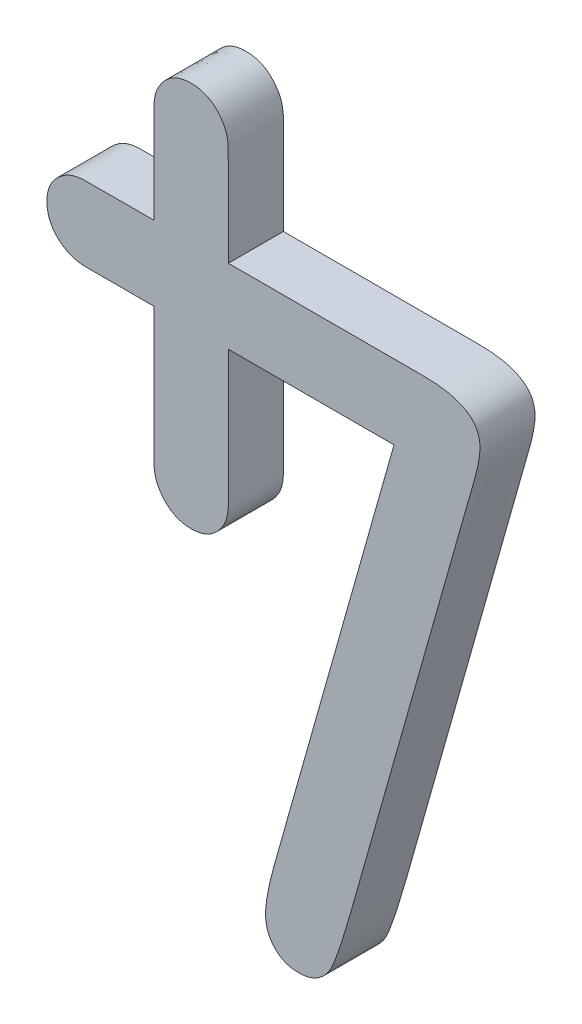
ISO-10303-21;
HEADER;
FILE_DESCRIPTION(('STEP AP214'),'2;1');
FILE_NAME('part.step','',(''),(''),'','','');
FILE_SCHEMA(('AUTOMOTIVE_DESIGN { 1 0 10303 214 1 1 1 1 }'));
ENDSEC;
DATA;
#1=APPLICATION_CONTEXT('core data for automotive mechanical design processes');
#2=APPLICATION_PROTOCOL_DEFINITION('international standard','automotive_design',2000,#1);
#3=PRODUCT_CONTEXT('',#1,'mechanical');
#4=PRODUCT('Part','Part','',(#3));
#5=PRODUCT_RELATED_PRODUCT_CATEGORY('part','',(#4));
#6=PRODUCT_DEFINITION_FORMATION('','',#4);
#7=PRODUCT_DEFINITION_CONTEXT('part definition',#1,'design');
#8=PRODUCT_DEFINITION('design','',#6,#7);
#9=PRODUCT_DEFINITION_SHAPE('','',#8);
#10=(LENGTH_UNIT() NAMED_UNIT(*) SI_UNIT(.MILLI.,.METRE.));
#11=(NAMED_UNIT(*) PLANE_ANGLE_UNIT() SI_UNIT($,.RADIAN.));
#12=(NAMED_UNIT(*) SI_UNIT($,.STERADIAN.) SOLID_ANGLE_UNIT());
#13=UNCERTAINTY_MEASURE_WITH_UNIT(LENGTH_MEASURE(1.E-05),#10,'distance_accuracy_value','');
#14=(GEOMETRIC_REPRESENTATION_CONTEXT(3) GLOBAL_UNCERTAINTY_ASSIGNED_CONTEXT((#13)) GLOBAL_UNIT_ASSIGNED_CONTEXT((#10,
#11,#12)) REPRESENTATION_CONTEXT('',''));
#15=CARTESIAN_POINT('',(0.,0.,0.));
#16=DIRECTION('',(0.,0.,1.));
#17=DIRECTION('',(1.,0.,0.));
#18=AXIS2_PLACEMENT_3D('',#15,#16,#17);
#19=CARTESIAN_POINT('',(-53.6737425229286,1.97828261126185,0.500000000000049));
#20=DIRECTION('',(0.,-1.,0.));
#21=DIRECTION('',(1.,0.,0.));
#22=AXIS2_PLACEMENT_3D('',#19,#20,#21);
#23=PLANE('',#22);
#24=CARTESIAN_POINT('',(-53.6737425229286,1.97828261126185,0.));
#25=CARTESIAN_POINT('',(-54.4261234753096,1.97828261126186,0.));
#26=CARTESIAN_POINT('',(-55.1785044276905,1.97828261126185,0.));
#27=B_SPLINE_CURVE_WITH_KNOTS('',2,(#24,#25,#26),.UNSPECIFIED.,.F.,.F.,(3,3),(0.,1.),.UNSPECIFIED.);
#28=CARTESIAN_POINT('',(-53.6737425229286,1.97828261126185,0.));
#29=VERTEX_POINT('',#28);
#30=CARTESIAN_POINT('',(-55.1785044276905,1.97828261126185,0.));
#31=VERTEX_POINT('',#30);
#32=EDGE_CURVE('E62',#29,#31,#27,.T.);
#33=ORIENTED_EDGE('',*,*,#32,.F.);
#34=DIRECTION('',(0.,0.,-1.));
#35=VECTOR('',#34,1.);
#36=CARTESIAN_POINT('',(-53.6737425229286,1.97828261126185,0.500000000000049));
#37=LINE('',#36,#35);
#38=CARTESIAN_POINT('',(-53.6737425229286,1.97828261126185,0.500000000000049));
#39=VERTEX_POINT('',#38);
#40=EDGE_CURVE('E31',#39,#29,#37,.T.);
#41=ORIENTED_EDGE('',*,*,#40,.F.);
#42=CARTESIAN_POINT('',(-53.6737425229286,1.97828261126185,0.500000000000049));
#43=CARTESIAN_POINT('',(-54.4261234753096,1.97828261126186,0.500000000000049));
#44=CARTESIAN_POINT('',(-55.1785044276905,1.97828261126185,0.500000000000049));
#45=B_SPLINE_CURVE_WITH_KNOTS('',2,(#42,#43,#44),.UNSPECIFIED.,.F.,.F.,(3,3),(0.,1.),.UNSPECIFIED.);
#46=CARTESIAN_POINT('',(-55.1785044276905,1.97828261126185,0.500000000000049));
#47=VERTEX_POINT('',#46);
#48=EDGE_CURVE('E64',#39,#47,#45,.T.);
#49=ORIENTED_EDGE('',*,*,#48,.T.);
#50=DIRECTION('',(0.,0.,-1.));
#51=VECTOR('',#50,1.);
#52=CARTESIAN_POINT('',(-55.1785044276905,1.97828261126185,0.500000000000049));
#53=LINE('',#52,#51);
#54=EDGE_CURVE('E11',#47,#31,#53,.T.);
#55=ORIENTED_EDGE('',*,*,#54,.T.);
#56=EDGE_LOOP('',(#33,#41,#49,#55));
#57=FACE_BOUND('',#56,.T.);
#58=ADVANCED_FACE('F16',(#57),#23,.T.);
#59=CARTESIAN_POINT('',(-55.1785044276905,1.97828261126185,0.500000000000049));
#60=CARTESIAN_POINT('',(-55.1785044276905,1.36875880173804,0.500000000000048));
#61=CARTESIAN_POINT('',(-55.1785044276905,0.759234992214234,0.500000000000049));
#62=CARTESIAN_POINT('',(-55.1785044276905,0.644949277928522,0.500000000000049));
#63=CARTESIAN_POINT('',(-55.224501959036,0.567792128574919,0.500000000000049));
#64=CARTESIAN_POINT('',(-55.3261234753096,0.397330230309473,0.500000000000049));
#65=CARTESIAN_POINT('',(-55.5165996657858,0.397330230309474,0.500000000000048));
#66=CARTESIAN_POINT('',(-55.707075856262,0.397330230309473,0.500000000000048));
#67=CARTESIAN_POINT('',(-55.8086973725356,0.567792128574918,0.500000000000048));
#68=CARTESIAN_POINT('',(-55.854694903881,0.64494927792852,0.500000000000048));
#69=CARTESIAN_POINT('',(-55.854694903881,0.759234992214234,0.500000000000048));
#70=CARTESIAN_POINT('',(-55.854694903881,1.36875880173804,0.500000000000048));
#71=CARTESIAN_POINT('',(-55.854694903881,1.97828261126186,0.500000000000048));
#72=B_SPLINE_CURVE_WITH_KNOTS('',2,(#59,#60,#61,#62,#63,#64,#65,#66,#67,#68,#69,#70,#71),
.UNSPECIFIED.,.F.,.F.,(3,2,2,2,2,2,3),(1.,2.,3.,4.,5.,6.,7.),.UNSPECIFIED.);
#73=DIRECTION('',(0.,0.,-1.));
#74=VECTOR('',#73,1.);
#75=SURFACE_OF_LINEAR_EXTRUSION('',#72,#74);
#76=CARTESIAN_POINT('',(-55.1785044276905,1.97828261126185,0.));
#77=CARTESIAN_POINT('',(-55.1785044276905,1.36875880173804,0.));
#78=CARTESIAN_POINT('',(-55.1785044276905,0.759234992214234,0.));
#79=CARTESIAN_POINT('',(-55.1785044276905,0.644949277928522,0.));
#80=CARTESIAN_POINT('',(-55.224501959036,0.567792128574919,0.));
#81=CARTESIAN_POINT('',(-55.3261234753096,0.397330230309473,0.));
#82=CARTESIAN_POINT('',(-55.5165996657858,0.397330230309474,0.));
#83=CARTESIAN_POINT('',(-55.707075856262,0.397330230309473,0.));
#84=CARTESIAN_POINT('',(-55.8086973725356,0.567792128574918,0.));
#85=CARTESIAN_POINT('',(-55.854694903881,0.64494927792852,0.));
#86=CARTESIAN_POINT('',(-55.854694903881,0.759234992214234,0.));
#87=CARTESIAN_POINT('',(-55.854694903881,1.36875880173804,0.));
#88=CARTESIAN_POINT('',(-55.854694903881,1.97828261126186,0.));
#89=B_SPLINE_CURVE_WITH_KNOTS('',2,(#76,#77,#78,#79,#80,#81,#82,#83,#84,#85,#86,#87,#88),
.UNSPECIFIED.,.F.,.F.,(3,2,2,2,2,2,3),(1.,2.,3.,4.,5.,6.,7.),.UNSPECIFIED.);
#90=CARTESIAN_POINT('',(-55.854694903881,1.97828261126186,0.));
#91=VERTEX_POINT('',#90);
#92=EDGE_CURVE('E69',#31,#91,#89,.T.);
#93=ORIENTED_EDGE('',*,*,#92,.F.);
#94=ORIENTED_EDGE('',*,*,#54,.F.);
#95=CARTESIAN_POINT('',(-55.854694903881,1.97828261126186,0.500000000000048));
#96=VERTEX_POINT('',#95);
#97=EDGE_CURVE('E129',#47,#96,#72,.T.);
#98=ORIENTED_EDGE('',*,*,#97,.T.);
#99=DIRECTION('',(0.,0.,-1.));
#100=VECTOR('',#99,1.);
#101=CARTESIAN_POINT('',(-55.854694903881,1.97828261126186,0.500000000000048));
#102=LINE('',#101,#100);
#103=EDGE_CURVE('E24',#96,#91,#102,.T.);
#104=ORIENTED_EDGE('',*,*,#103,.T.);
#105=EDGE_LOOP('',(#93,#94,#98,#104));
#106=FACE_BOUND('',#105,.T.);
#107=ADVANCED_FACE('F70',(#106),#75,.T.);
#108=CARTESIAN_POINT('',(-55.854694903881,1.97828261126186,0.500000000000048));
#109=CARTESIAN_POINT('',(-56.1594568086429,1.97828261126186,0.500000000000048));
#110=CARTESIAN_POINT('',(-56.4642187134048,1.97828261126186,0.500000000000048));
#111=CARTESIAN_POINT('',(-56.5785044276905,1.97828261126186,0.500000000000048));
#112=CARTESIAN_POINT('',(-56.6556615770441,2.02428014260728,0.500000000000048));
#113=CARTESIAN_POINT('',(-56.8261234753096,2.12590165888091,0.500000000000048));
#114=CARTESIAN_POINT('',(-56.8261234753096,2.31637784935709,0.500000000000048));
#115=CARTESIAN_POINT('',(-56.8261234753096,2.50685403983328,0.500000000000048));
#116=CARTESIAN_POINT('',(-56.6556615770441,2.60847555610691,0.500000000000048));
#117=CARTESIAN_POINT('',(-56.5785044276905,2.65447308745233,0.500000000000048));
#118=CARTESIAN_POINT('',(-56.4642187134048,2.65447308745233,0.500000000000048));
#119=CARTESIAN_POINT('',(-56.1594568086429,2.65447308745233,0.500000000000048));
#120=CARTESIAN_POINT('',(-55.854694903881,2.65447308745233,0.500000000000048));
#121=B_SPLINE_CURVE_WITH_KNOTS('',2,(#108,#109,#110,#111,#112,#113,#114,#115,#116,#117,#118,
#119,#120),.UNSPECIFIED.,.F.,.F.,(3,2,2,2,2,2,3),(7.,8.,9.,10.,11.,12.,13.),.UNSPECIFIED.);
#122=DIRECTION('',(0.,0.,-1.));
#123=VECTOR('',#122,1.);
#124=SURFACE_OF_LINEAR_EXTRUSION('',#121,#123);
#125=CARTESIAN_POINT('',(-55.854694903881,1.97828261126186,0.));
#126=CARTESIAN_POINT('',(-56.1594568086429,1.97828261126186,0.));
#127=CARTESIAN_POINT('',(-56.4642187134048,1.97828261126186,0.));
#128=CARTESIAN_POINT('',(-56.5785044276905,1.97828261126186,0.));
#129=CARTESIAN_POINT('',(-56.6556615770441,2.02428014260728,0.));
#130=CARTESIAN_POINT('',(-56.8261234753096,2.12590165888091,0.));
#131=CARTESIAN_POINT('',(-56.8261234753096,2.31637784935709,0.));
#132=CARTESIAN_POINT('',(-56.8261234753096,2.50685403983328,0.));
#133=CARTESIAN_POINT('',(-56.6556615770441,2.60847555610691,0.));
#134=CARTESIAN_POINT('',(-56.5785044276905,2.65447308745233,0.));
#135=CARTESIAN_POINT('',(-56.4642187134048,2.65447308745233,0.));
#136=CARTESIAN_POINT('',(-56.1594568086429,2.65447308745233,0.));
#137=CARTESIAN_POINT('',(-55.854694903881,2.65447308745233,0.));
#138=B_SPLINE_CURVE_WITH_KNOTS('',2,(#125,#126,#127,#128,#129,#130,#131,#132,#133,#134,#135,
#136,#137),.UNSPECIFIED.,.F.,.F.,(3,2,2,2,2,2,3),(7.,8.,9.,10.,11.,12.,13.),.UNSPECIFIED.);
#139=CARTESIAN_POINT('',(-55.854694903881,2.65447308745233,0.));
#140=VERTEX_POINT('',#139);
#141=EDGE_CURVE('E75',#91,#140,#138,.T.);
#142=ORIENTED_EDGE('',*,*,#141,.F.);
#143=ORIENTED_EDGE('',*,*,#103,.F.);
#144=CARTESIAN_POINT('',(-55.854694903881,2.65447308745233,0.500000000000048));
#145=VERTEX_POINT('',#144);
#146=EDGE_CURVE('E138',#96,#145,#121,.T.);
#147=ORIENTED_EDGE('',*,*,#146,.T.);
#148=DIRECTION('',(0.,0.,-1.));
#149=VECTOR('',#148,1.);
#150=CARTESIAN_POINT('',(-55.854694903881,2.65447308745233,0.500000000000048));
#151=LINE('',#150,#149);
#152=EDGE_CURVE('E179',#145,#140,#151,.T.);
#153=ORIENTED_EDGE('',*,*,#152,.T.);
#154=EDGE_LOOP('',(#142,#143,#147,#153));
#155=FACE_BOUND('',#154,.T.);
#156=ADVANCED_FACE('F148',(#155),#124,.T.);
#157=CARTESIAN_POINT('',(-55.854694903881,2.65447308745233,0.500000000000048));
#158=CARTESIAN_POINT('',(-55.854694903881,3.09733023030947,0.500000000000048));
#159=CARTESIAN_POINT('',(-55.854694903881,3.54018737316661,0.500000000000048));
#160=CARTESIAN_POINT('',(-55.854694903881,3.65447308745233,0.500000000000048));
#161=CARTESIAN_POINT('',(-55.8086973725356,3.73163023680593,0.500000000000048));
#162=CARTESIAN_POINT('',(-55.707075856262,3.90209213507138,0.500000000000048));
#163=CARTESIAN_POINT('',(-55.5165996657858,3.90209213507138,0.500000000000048));
#164=CARTESIAN_POINT('',(-55.3261234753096,3.90209213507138,0.500000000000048));
#165=CARTESIAN_POINT('',(-55.224501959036,3.73163023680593,0.500000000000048));
#166=CARTESIAN_POINT('',(-55.1785044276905,3.65447308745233,0.500000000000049));
#167=CARTESIAN_POINT('',(-55.1785044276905,3.54018737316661,0.500000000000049));
#168=CARTESIAN_POINT('',(-55.1785044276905,3.09733023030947,0.500000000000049));
#169=CARTESIAN_POINT('',(-55.1785044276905,2.65447308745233,0.500000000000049));
#170=B_SPLINE_CURVE_WITH_KNOTS('',2,(#157,#158,#159,#160,#161,#162,#163,#164,#165,#166,#167,
#168,#169),.UNSPECIFIED.,.F.,.F.,(3,2,2,2,2,2,3),(13.,14.,15.,16.,17.,18.,19.),.UNSPECIFIED.);
#171=DIRECTION('',(0.,0.,-1.));
#172=VECTOR('',#171,1.);
#173=SURFACE_OF_LINEAR_EXTRUSION('',#170,#172);
#174=CARTESIAN_POINT('',(-55.854694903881,2.65447308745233,0.));
#175=CARTESIAN_POINT('',(-55.854694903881,3.09733023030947,0.));
#176=CARTESIAN_POINT('',(-55.854694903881,3.54018737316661,0.));
#177=CARTESIAN_POINT('',(-55.854694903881,3.65447308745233,0.));
#178=CARTESIAN_POINT('',(-55.8086973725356,3.73163023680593,0.));
#179=CARTESIAN_POINT('',(-55.707075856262,3.90209213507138,0.));
#180=CARTESIAN_POINT('',(-55.5165996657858,3.90209213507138,0.));
#181=CARTESIAN_POINT('',(-55.3261234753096,3.90209213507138,0.));
#182=CARTESIAN_POINT('',(-55.224501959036,3.73163023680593,0.));
#183=CARTESIAN_POINT('',(-55.1785044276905,3.65447308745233,0.));
#184=CARTESIAN_POINT('',(-55.1785044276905,3.54018737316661,0.));
#185=CARTESIAN_POINT('',(-55.1785044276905,3.09733023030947,0.));
#186=CARTESIAN_POINT('',(-55.1785044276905,2.65447308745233,0.));
#187=B_SPLINE_CURVE_WITH_KNOTS('',2,(#174,#175,#176,#177,#178,#179,#180,#181,#182,#183,#184,
#185,#186),.UNSPECIFIED.,.F.,.F.,(3,2,2,2,2,2,3),(13.,14.,15.,16.,17.,18.,19.),.UNSPECIFIED.);
#188=CARTESIAN_POINT('',(-55.1785044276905,2.65447308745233,0.));
#189=VERTEX_POINT('',#188);
#190=EDGE_CURVE('E107',#140,#189,#187,.T.);
#191=ORIENTED_EDGE('',*,*,#190,.F.);
#192=ORIENTED_EDGE('',*,*,#152,.F.);
#193=CARTESIAN_POINT('',(-55.1785044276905,2.65447308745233,0.500000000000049));
#194=VERTEX_POINT('',#193);
#195=EDGE_CURVE('E159',#145,#194,#170,.T.);
#196=ORIENTED_EDGE('',*,*,#195,.T.);
#197=DIRECTION('',(0.,0.,-1.));
#198=VECTOR('',#197,1.);
#199=CARTESIAN_POINT('',(-55.1785044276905,2.65447308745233,0.500000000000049));
#200=LINE('',#199,#198);
#201=EDGE_CURVE('E38',#194,#189,#200,.T.);
#202=ORIENTED_EDGE('',*,*,#201,.T.);
#203=EDGE_LOOP('',(#191,#192,#196,#202));
#204=FACE_BOUND('',#203,.T.);
#205=ADVANCED_FACE('F151',(#204),#173,.T.);
#206=CARTESIAN_POINT('',(-55.1785044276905,2.65447308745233,0.500000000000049));
#207=CARTESIAN_POINT('',(-54.2927901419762,2.65447308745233,0.500000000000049));
#208=CARTESIAN_POINT('',(-53.407075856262,2.65447308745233,0.500000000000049));
#209=CARTESIAN_POINT('',(-52.8927901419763,2.65447308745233,0.500000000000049));
#210=CARTESIAN_POINT('',(-52.8927901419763,2.34494927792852,0.500000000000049));
#211=CARTESIAN_POINT('',(-52.8927901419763,2.24494927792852,0.500000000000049));
#212=CARTESIAN_POINT('',(-52.9550998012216,2.02601689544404,0.500000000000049));
#213=CARTESIAN_POINT('',(-53.504694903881,0.0949492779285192,0.500000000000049));
#214=CARTESIAN_POINT('',(-54.0499893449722,-1.83733102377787,0.500000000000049));
#215=CARTESIAN_POINT('',(-54.1880282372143,-2.32647929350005,0.500000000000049));
#216=CARTESIAN_POINT('',(-54.250841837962,-2.43547936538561,0.500000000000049));
#217=CARTESIAN_POINT('',(-54.3499329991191,-2.60743167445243,0.500000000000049));
#218=CARTESIAN_POINT('',(-54.5404091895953,-2.60743167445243,0.500000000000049));
#219=CARTESIAN_POINT('',(-54.6927901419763,-2.60743167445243,0.500000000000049));
#220=CARTESIAN_POINT('',(-54.7779837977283,-2.49750437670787,0.500000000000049));
#221=CARTESIAN_POINT('',(-54.8404091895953,-2.41695548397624,0.500000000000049));
#222=CARTESIAN_POINT('',(-54.8404091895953,-2.29314596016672,0.500000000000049));
#223=CARTESIAN_POINT('',(-54.8404091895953,-2.15028881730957,0.500000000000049));
#224=CARTESIAN_POINT('',(-54.7543443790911,-1.84562593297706,0.500000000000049));
#225=CARTESIAN_POINT('',(-54.2142187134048,0.066377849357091,0.500000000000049));
#226=CARTESIAN_POINT('',(-53.6737425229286,1.97828261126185,0.500000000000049));
#227=B_SPLINE_CURVE_WITH_KNOTS('',2,(#206,#207,#208,#209,#210,#211,#212,#213,#214,#215,#216,
#217,#218,#219,#220,#221,#222,#223,#224,#225,#226),.UNSPECIFIED.,.F.,.F.,(3,2,2,2,2,2,2,2,2,2,
3),(19.,20.,21.,22.,23.,24.,25.,26.,27.,28.,29.),.UNSPECIFIED.);
#228=DIRECTION('',(0.,0.,-1.));
#229=VECTOR('',#228,1.);
#230=SURFACE_OF_LINEAR_EXTRUSION('',#227,#229);
#231=CARTESIAN_POINT('',(-55.1785044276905,2.65447308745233,0.));
#232=CARTESIAN_POINT('',(-54.2927901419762,2.65447308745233,0.));
#233=CARTESIAN_POINT('',(-53.407075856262,2.65447308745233,0.));
#234=CARTESIAN_POINT('',(-52.8927901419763,2.65447308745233,0.));
#235=CARTESIAN_POINT('',(-52.8927901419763,2.34494927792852,0.));
#236=CARTESIAN_POINT('',(-52.8927901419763,2.24494927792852,0.));
#237=CARTESIAN_POINT('',(-52.9550998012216,2.02601689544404,0.));
#238=CARTESIAN_POINT('',(-53.504694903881,0.0949492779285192,0.));
#239=CARTESIAN_POINT('',(-54.0499893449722,-1.83733102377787,0.));
#240=CARTESIAN_POINT('',(-54.1880282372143,-2.32647929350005,0.));
#241=CARTESIAN_POINT('',(-54.250841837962,-2.43547936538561,0.));
#242=CARTESIAN_POINT('',(-54.3499329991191,-2.60743167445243,0.));
#243=CARTESIAN_POINT('',(-54.5404091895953,-2.60743167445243,0.));
#244=CARTESIAN_POINT('',(-54.6927901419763,-2.60743167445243,0.));
#245=CARTESIAN_POINT('',(-54.7779837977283,-2.49750437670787,0.));
#246=CARTESIAN_POINT('',(-54.8404091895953,-2.41695548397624,0.));
#247=CARTESIAN_POINT('',(-54.8404091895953,-2.29314596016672,0.));
#248=CARTESIAN_POINT('',(-54.8404091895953,-2.15028881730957,0.));
#249=CARTESIAN_POINT('',(-54.7543443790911,-1.84562593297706,0.));
#250=CARTESIAN_POINT('',(-54.2142187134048,0.066377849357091,0.));
#251=CARTESIAN_POINT('',(-53.6737425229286,1.97828261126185,0.));
#252=B_SPLINE_CURVE_WITH_KNOTS('',2,(#231,#232,#233,#234,#235,#236,#237,#238,#239,#240,#241,
#242,#243,#244,#245,#246,#247,#248,#249,#250,#251),.UNSPECIFIED.,.F.,.F.,(3,2,2,2,2,2,2,2,2,2,
3),(19.,20.,21.,22.,23.,24.,25.,26.,27.,28.,29.),.UNSPECIFIED.);
#253=EDGE_CURVE('E80',#189,#29,#252,.T.);
#254=ORIENTED_EDGE('',*,*,#253,.F.);
#255=ORIENTED_EDGE('',*,*,#201,.F.);
#256=EDGE_CURVE('E164',#194,#39,#227,.T.);
#257=ORIENTED_EDGE('',*,*,#256,.T.);
#258=ORIENTED_EDGE('',*,*,#40,.T.);
#259=EDGE_LOOP('',(#254,#255,#257,#258));
#260=FACE_BOUND('',#259,.T.);
#261=ADVANCED_FACE('F155',(#260),#230,.T.);
#262=CARTESIAN_POINT('',(-55.5165996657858,0.397330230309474,0.500000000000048));
#263=DIRECTION('',(0.,0.,1.));
#264=DIRECTION('',(0.948007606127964,-0.318247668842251,0.));
#265=AXIS2_PLACEMENT_3D('',#262,#263,#264);
#266=PLANE('',#265);
#267=ORIENTED_EDGE('',*,*,#48,.F.);
#268=ORIENTED_EDGE('',*,*,#256,.F.);
#269=ORIENTED_EDGE('',*,*,#195,.F.);
#270=ORIENTED_EDGE('',*,*,#146,.F.);
#271=ORIENTED_EDGE('',*,*,#97,.F.);
#272=EDGE_LOOP('',(#267,#268,#269,#270,#271));
#273=FACE_BOUND('',#272,.T.);
#274=ADVANCED_FACE('F293',(#273),#266,.T.);
#275=CARTESIAN_POINT('',(-55.5165996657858,0.397330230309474,0.));
#276=DIRECTION('',(0.,0.,1.));
#277=DIRECTION('',(0.948007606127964,-0.318247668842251,0.));
#278=AXIS2_PLACEMENT_3D('',#275,#276,#277);
#279=PLANE('',#278);
#280=ORIENTED_EDGE('',*,*,#32,.T.);
#281=ORIENTED_EDGE('',*,*,#92,.T.);
#282=ORIENTED_EDGE('',*,*,#141,.T.);
#283=ORIENTED_EDGE('',*,*,#190,.T.);
#284=ORIENTED_EDGE('',*,*,#253,.T.);
#285=EDGE_LOOP('',(#280,#281,#282,#283,#284));
#286=FACE_BOUND('',#285,.T.);
#287=ADVANCED_FACE('F78',(#286),#279,.F.);
#288=CLOSED_SHELL('',(#58,#107,#156,#205,#261,#274,#287));
#289=MANIFOLD_SOLID_BREP('B1',#288);
#290=ADVANCED_BREP_SHAPE_REPRESENTATION('',(#18,#289),#14);
#291=SHAPE_DEFINITION_REPRESENTATION(#9,#290);
ENDSEC;
END-ISO-10303-21;
